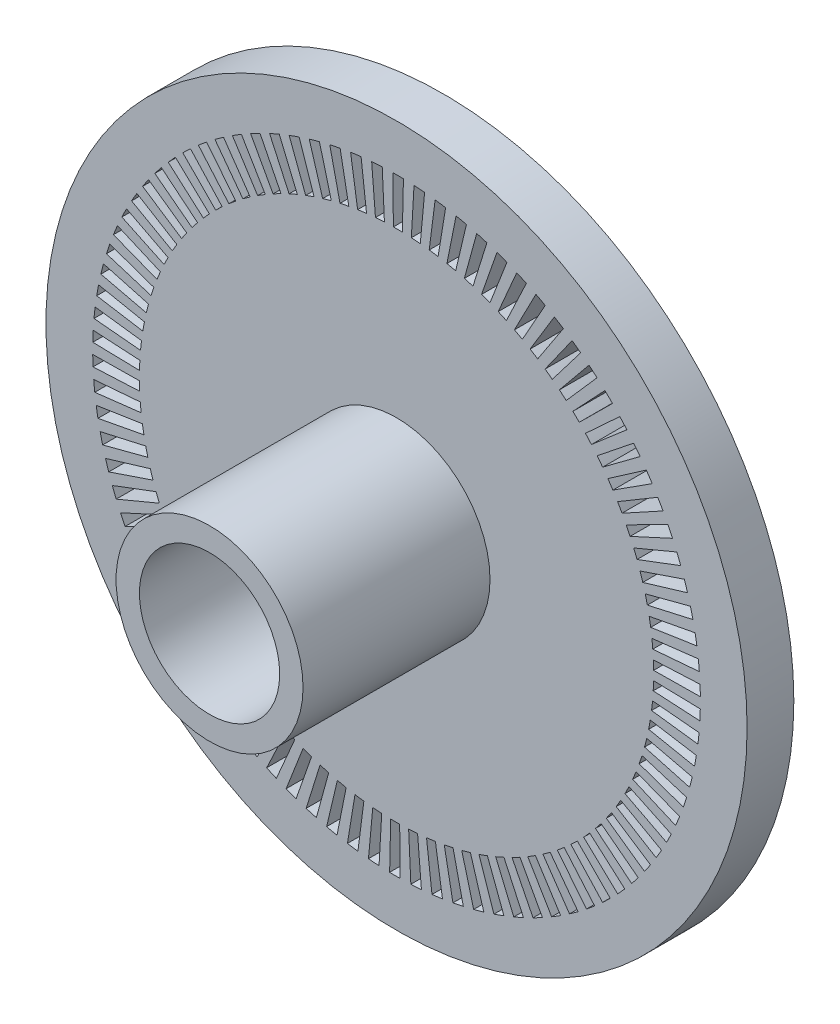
from build123d import *

# Parameters (mm, degrees)
ESQUISSE1_R                  = 7.5
BOSS_EXTRU_1_DEPTH           = 1
ESQUISSE2_R                  = 2
BOSS_EXTRU_2_DEPTH           = 4
ESQUISSE3_R                  = 1.5
ENL_V_MAT_EXTRU_1_DEPTH      = 14
ESQUISSE4_R                  = 6.5
ESQUISSE4_R_2                = 5.5
ENL_V_MAT_EXTRU_2_DEPTH      = 14
BOSS_EXTRU_3_DEPTH           = 1
R_P_TITION_CIRCULAIRE1_COUNT = 90


with BuildPart() as part:
    # Esquisse1 → Boss.-Extru.1 (new body)
    with BuildSketch(Plane.XY):
        Circle(ESQUISSE1_R)
    extrude(amount=BOSS_EXTRU_1_DEPTH)

    # Esquisse2 → Boss.-Extru.2 (add)
    with BuildSketch(Plane.XY.offset(1)):
        Circle(ESQUISSE2_R)
    extrude(amount=BOSS_EXTRU_2_DEPTH)

    # Esquisse3 → Enl_v. mat.-Extru.1 (cut)
    with BuildSketch(Plane.XY.offset(5)):
        Circle(ESQUISSE3_R)
    extrude(amount=-ENL_V_MAT_EXTRU_1_DEPTH, mode=Mode.SUBTRACT)

    # Esquisse4 → Enl_v. mat.-Extru.2 (cut)
    with BuildSketch(Plane(origin=(0, 0, 0), x_dir=(-1, 0, 0), z_dir=(0, 0, -1))):
        Circle(ESQUISSE4_R)
        Circle(ESQUISSE4_R_2, mode=Mode.SUBTRACT)
    extrude(amount=-ENL_V_MAT_EXTRU_2_DEPTH, mode=Mode.SUBTRACT)


with BuildPart() as enl_v_mat_extru_2_piece_1:
    # of the separate pieces the step leaves, piece 1, a body of its own (enl_v_mat_extru_2_pieces)
    add(part.part.solids().sort_by_distance((-5.5, 0, 0))[0])



with BuildPart() as enl_v_mat_extru_2_piece_2:
    # of the separate pieces the step leaves, piece 2, a body of its own (enl_v_mat_extru_2_pieces)
    add(part.part.solids().sort_by_distance((7.5, 0, 0))[0])


with BuildPart() as enl_v_mat_extru_2_piece_1_1:
    add(enl_v_mat_extru_2_piece_1.part)

    add(enl_v_mat_extru_2_piece_2.part)  # Boss.-Extru.3 merges Enl_v. mat.-Extru.2 piece 2
    # Esquisse5 → Boss.-Extru.3 (add)
    with BuildSketch(Plane(origin=(0, 0, 0), x_dir=(-1, 0, 0), z_dir=(0, 0, -1))):
        with BuildLine():
            Line((-0.48585966, 3.792378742), (-0.880926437, 6.876073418))
            Line((-0.880926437, 6.876073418), (-0.632374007, 6.815924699))
            Line((-0.632374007, 6.815924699), (-0.353211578, 3.807024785))
            ThreePointArc((-0.353211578, 3.807024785), (-0.419599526, 3.800280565), (-0.48585966, 3.792378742))
        make_face()
    boss_extru_3 = extrude(amount=-BOSS_EXTRU_3_DEPTH)

    # R_p_tition circulaire1: Boss.-Extru.3 ×90 about axis
    r_p_tition_circulaire1_axis = Axis((0, 0, 0), (0, 0, 1))
    for i in range(1, R_P_TITION_CIRCULAIRE1_COUNT):
        add(boss_extru_3.rotate(r_p_tition_circulaire1_axis, i * 360 / R_P_TITION_CIRCULAIRE1_COUNT))


solid = enl_v_mat_extru_2_piece_1_1.part
